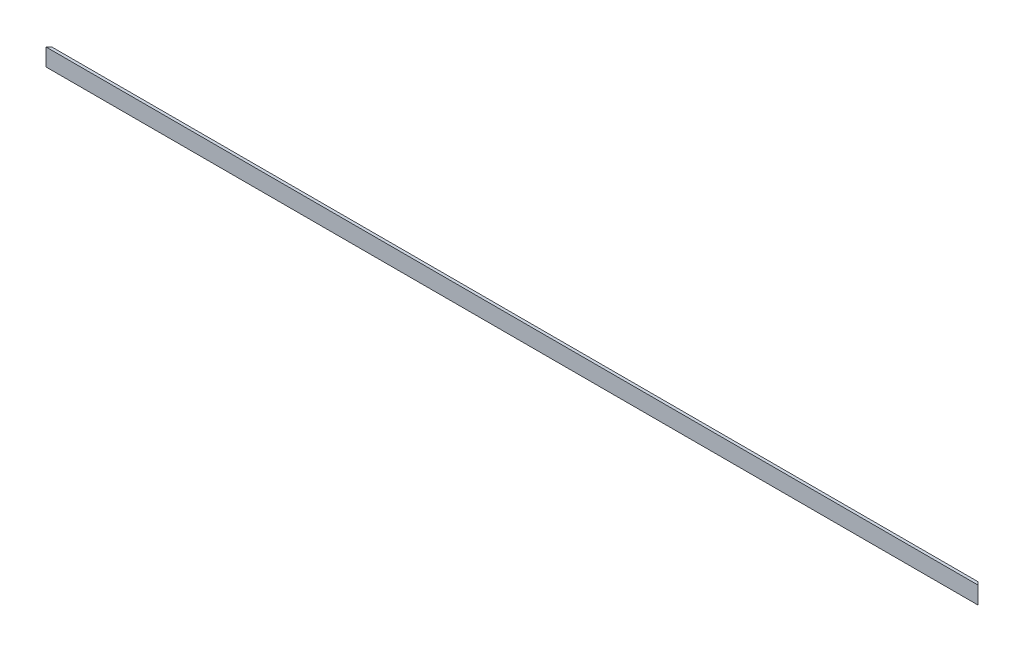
from build123d import *

# Parameters (mm, degrees)
BOSS_EXTRUDE1_DEPTH = 2047.24
CUT_EXTRUDE3_DEPTH  = 2048.948934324


with BuildPart() as part:
    # Sketch1 → Boss-Extrude1 (new body)
    with BuildSketch(Plane(origin=(0, 0, 0), x_dir=(0, 0, -1), z_dir=(1, 0, 0))):
        Polygon((0, 0), (0, 38.1), (6.35, 38.1), (6.35, 6.35), (38.1, 6.35), (38.1, 0), align=None)
    extrude(amount=BOSS_EXTRUDE1_DEPTH)

    # Sketch2 → Cut-Extrude3 (cut, through all)
    with BuildSketch(Plane(origin=(0, 0, 0), x_dir=(1, 0, 0), z_dir=(0, 1, 0))):
        Polygon((0, 0), (38.1, 38.1), (0, 38.1), align=None)
        Polygon((2047.24, 0), (2009.14, 38.1), (2047.24, 38.1), align=None)
    extrude(amount=CUT_EXTRUDE3_DEPTH, mode=Mode.SUBTRACT)


solid = part.part
